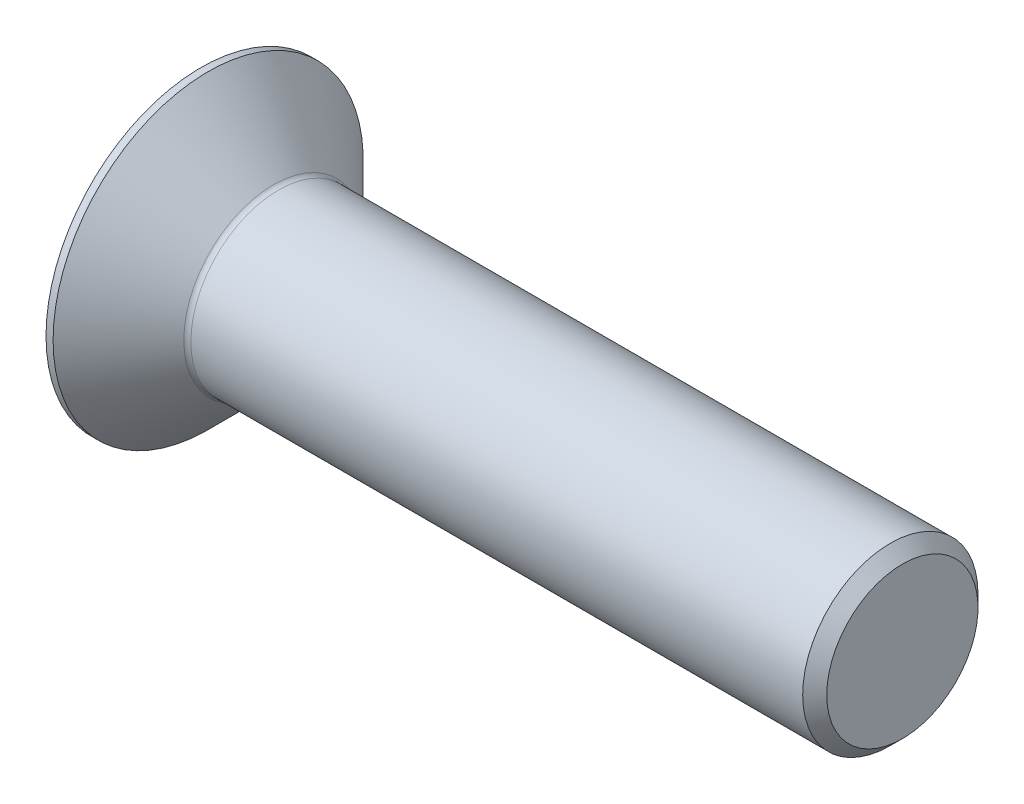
from build123d import *

# Parameters (mm, degrees)
FILLET1_R   = 0.8
HEX_2_DEPTH = 5.6


with BuildPart() as part:
    # BodySke → BaseBody (revolve)
    with BuildSketch(Plane.XY, mode=Mode.PRIVATE) as basebody_sk:
        Polygon((0, 0), (0, 17.69), (0.81, 17.69), (8.5, 10), (78.626, 10), (80, 8.626), (80, 0), align=None)
    revolve(basebody_sk.sketch.rotate(Axis((0, 0, 0), (1, 0, 0)), 90), axis=Axis((0, 0, 0), (1, 0, 0)))

    # Fillet1
    fillet1_edges = [part.edges().sort_by_distance(p)[0] for p in [
        (8.5, 0, -10),
    ]]
    fillet(fillet1_edges, radius=FILLET1_R)

    # Sketch2 → PreBroach (revolve, cut)
    with BuildSketch(Plane.XY, mode=Mode.PRIVATE) as prebroach_sk:
        Polygon((0, 6), (5.6, 6), (9.064101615, 0), (0, 0), align=None)
    revolve(prebroach_sk.sketch.rotate(Axis((0, 0, 0), (1, 0, 0)), 90), axis=Axis((0, 0, 0), (1, 0, 0)), mode=Mode.SUBTRACT)

    # Sketch3 → Hex 2 (cut)
    with BuildSketch(Plane.ZY):
        Polygon((-6, -3.464101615), (-6, 3.464101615), (0, 6.92820323), (6, 3.464101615), (6, -3.464101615), (0, -6.92820323), align=None)
    extrude(amount=-HEX_2_DEPTH, mode=Mode.SUBTRACT)


solid = part.part
